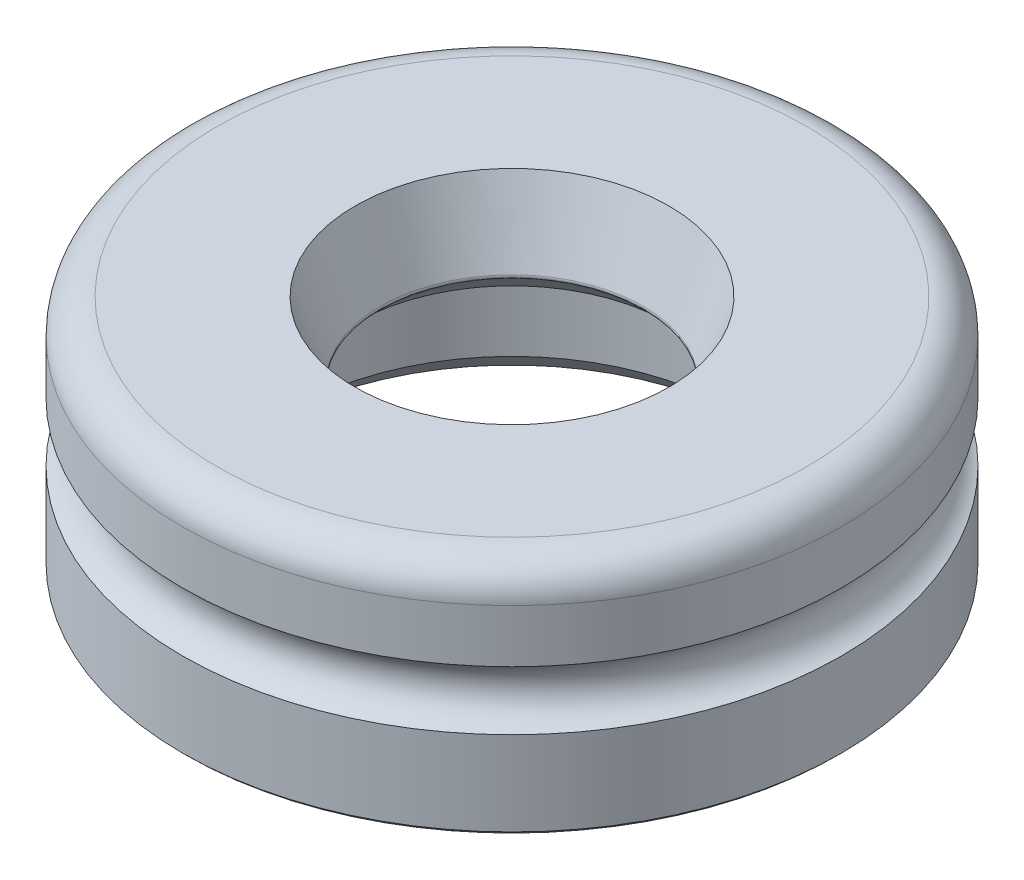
from build123d import *

# Parameters (mm, degrees)
CONG_1_R        = 0.2
CONG_2_R        = 2
CHANFREIN1_SIZE = 1.5
ESQUISSE5_R     = 1.8
CHANFREIN2_SIZE = 0.2


with BuildPart() as part:
    # Esquisse1 → R_volution1 (revolve)
    with BuildSketch(Plane.XY, mode=Mode.PRIVATE) as r_volution1_sk:
        with BuildLine():
            Line((-12.75, 0.5), (-12.75, 8))
            Line((-12.75, 8), (-9.210863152, 8))
            ThreePointArc((-9.210863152, 8), (-8.410571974, 8.837549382), (-7.534450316, 9.595418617))
            Line((-7.534450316, 9.595418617), (-9.051069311, 14))
            Line((-9.051069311, 14), (-19, 14))
            Line((-19, 14), (-19, 0.5))
            Line((-19, 0.5), (-12.75, 0.5))
        make_face()
    revolve(r_volution1_sk.sketch.rotate(Axis((0, 0, 0), (0, 1, 0)), 270), axis=Axis((0, 0, 0), (0, 1, 0)))

    # Cong_1
    cong_1_edges = [part.edges().sort_by_distance(p)[0] for p in [
        (0, 9.595418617, 7.534450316),
        (0, 8, 9.210863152),
    ]]
    fillet(cong_1_edges, radius=CONG_1_R)

    # Cong_2
    cong_2_edges = [part.edges().sort_by_distance(p)[0] for p in [
        (0, 14, 19),
    ]]
    fillet(cong_2_edges, radius=CONG_2_R)

    # Chanfrein1
    chanfrein1_edges = [part.edges().sort_by_distance(p)[0] for p in [
        (0, 0.5, 12.75),
    ]]
    chamfer(chanfrein1_edges, length=CHANFREIN1_SIZE)

    # Esquisse5 → Enl_vement de mati_re-R_volution1 (revolve, cut)
    with BuildSketch(Plane.XY, mode=Mode.PRIVATE) as enl_vement_de_mati_re_r_volution1_sk:
        with Locations((-19.6, 7.25)):
            Circle(ESQUISSE5_R)
    revolve(enl_vement_de_mati_re_r_volution1_sk.sketch.rotate(Axis((0, 0, 0), (0, 1, 0)), 270), axis=Axis((0, 0, 0), (0, 1, 0)), mode=Mode.SUBTRACT)

    # Chanfrein2
    chanfrein2_edges = [part.edges().sort_by_distance(p)[0] for p in [
        (0, 0.5, 19),
    ]]
    chamfer(chanfrein2_edges, length=CHANFREIN2_SIZE)


solid = part.part
